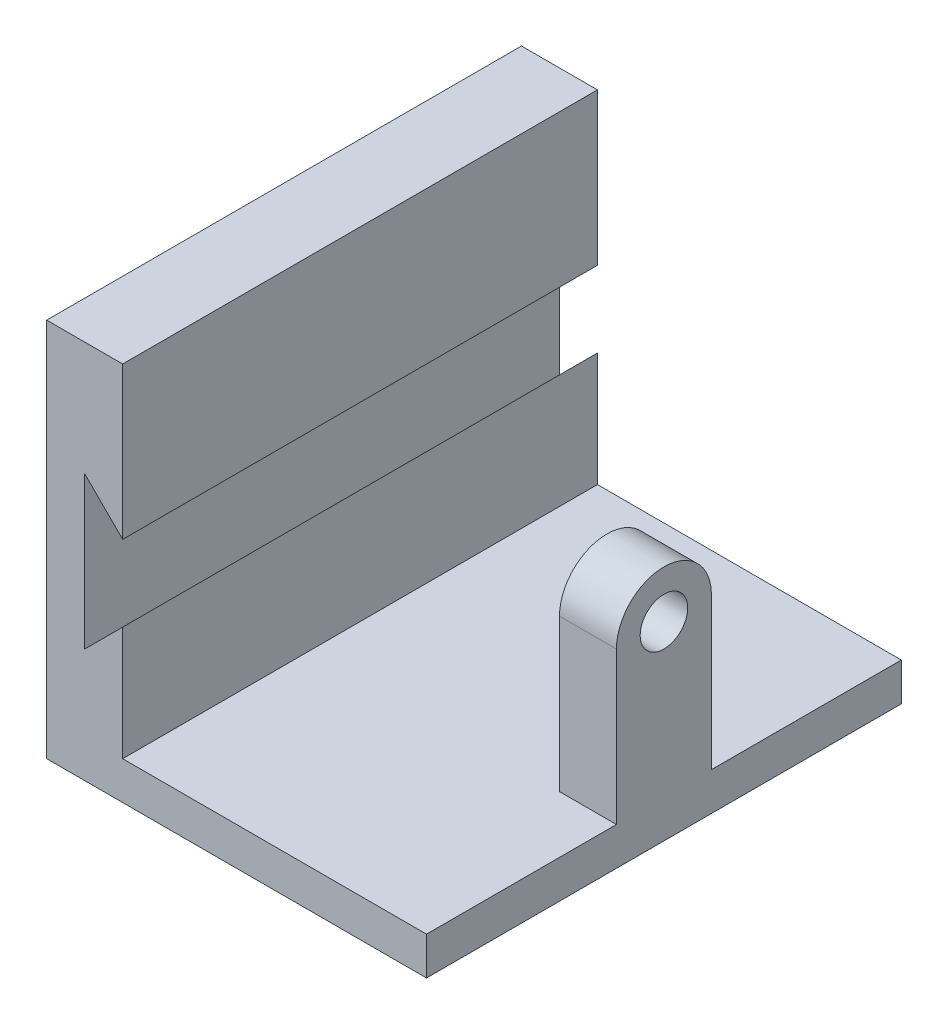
ISO-10303-21;
HEADER;
FILE_DESCRIPTION(('STEP AP214'),'2;1');
FILE_NAME('part.step','',(''),(''),'','','');
FILE_SCHEMA(('AUTOMOTIVE_DESIGN { 1 0 10303 214 1 1 1 1 }'));
ENDSEC;
DATA;
#1=APPLICATION_CONTEXT('core data for automotive mechanical design processes');
#2=APPLICATION_PROTOCOL_DEFINITION('international standard','automotive_design',2000,#1);
#3=PRODUCT_CONTEXT('',#1,'mechanical');
#4=PRODUCT('Part','Part','',(#3));
#5=PRODUCT_RELATED_PRODUCT_CATEGORY('part','',(#4));
#6=PRODUCT_DEFINITION_FORMATION('','',#4);
#7=PRODUCT_DEFINITION_CONTEXT('part definition',#1,'design');
#8=PRODUCT_DEFINITION('design','',#6,#7);
#9=PRODUCT_DEFINITION_SHAPE('','',#8);
#10=(LENGTH_UNIT() NAMED_UNIT(*) SI_UNIT(.MILLI.,.METRE.));
#11=(NAMED_UNIT(*) PLANE_ANGLE_UNIT() SI_UNIT($,.RADIAN.));
#12=(NAMED_UNIT(*) SI_UNIT($,.STERADIAN.) SOLID_ANGLE_UNIT());
#13=UNCERTAINTY_MEASURE_WITH_UNIT(LENGTH_MEASURE(1.E-05),#10,'distance_accuracy_value','');
#14=(GEOMETRIC_REPRESENTATION_CONTEXT(3) GLOBAL_UNCERTAINTY_ASSIGNED_CONTEXT((#13)) GLOBAL_UNIT_ASSIGNED_CONTEXT((#10,
#11,#12)) REPRESENTATION_CONTEXT('',''));
#15=CARTESIAN_POINT('',(0.,0.,0.));
#16=DIRECTION('',(0.,0.,1.));
#17=DIRECTION('',(1.,0.,0.));
#18=AXIS2_PLACEMENT_3D('',#15,#16,#17);
#19=CARTESIAN_POINT('',(0.,20.,125.));
#20=DIRECTION('',(-1.,0.,0.));
#21=DIRECTION('',(0.,-1.,0.));
#22=AXIS2_PLACEMENT_3D('',#19,#20,#21);
#23=PLANE('',#22);
#24=DIRECTION('',(0.,0.,-1.));
#25=VECTOR('',#24,1.);
#26=CARTESIAN_POINT('',(0.,0.,125.));
#27=LINE('',#26,#25);
#28=CARTESIAN_POINT('',(0.,0.,125.));
#29=VERTEX_POINT('',#28);
#30=CARTESIAN_POINT('',(0.,0.,-125.));
#31=VERTEX_POINT('',#30);
#32=EDGE_CURVE('E197',#29,#31,#27,.T.);
#33=ORIENTED_EDGE('',*,*,#32,.T.);
#34=DIRECTION('',(0.,1.,0.));
#35=VECTOR('',#34,1.);
#36=CARTESIAN_POINT('',(0.,20.,-125.));
#37=LINE('',#36,#35);
#38=CARTESIAN_POINT('',(0.,20.,-125.));
#39=VERTEX_POINT('',#38);
#40=EDGE_CURVE('E174',#31,#39,#37,.T.);
#41=ORIENTED_EDGE('',*,*,#40,.T.);
#42=DIRECTION('',(0.,0.,-1.));
#43=VECTOR('',#42,1.);
#44=CARTESIAN_POINT('',(0.,20.,125.));
#45=LINE('',#44,#43);
#46=CARTESIAN_POINT('',(0.,20.,-25.));
#47=VERTEX_POINT('',#46);
#48=EDGE_CURVE('E44',#47,#39,#45,.T.);
#49=ORIENTED_EDGE('',*,*,#48,.F.);
#50=DIRECTION('',(0.,1.,0.));
#51=VECTOR('',#50,1.);
#52=CARTESIAN_POINT('',(0.,0.,-25.));
#53=LINE('',#52,#51);
#54=CARTESIAN_POINT('',(0.,100.,-25.));
#55=VERTEX_POINT('',#54);
#56=EDGE_CURVE('E157',#47,#55,#53,.T.);
#57=ORIENTED_EDGE('',*,*,#56,.T.);
#58=CARTESIAN_POINT('',(0.,100.,0.));
#59=DIRECTION('',(1.,0.,0.));
#60=DIRECTION('',(0.,1.,0.));
#61=AXIS2_PLACEMENT_3D('',#58,#59,#60);
#62=CIRCLE('',#61,25.);
#63=CARTESIAN_POINT('',(0.,100.,25.));
#64=VERTEX_POINT('',#63);
#65=EDGE_CURVE('E165',#55,#64,#62,.T.);
#66=ORIENTED_EDGE('',*,*,#65,.T.);
#67=DIRECTION('',(0.,-1.,0.));
#68=VECTOR('',#67,1.);
#69=CARTESIAN_POINT('',(0.,100.,25.));
#70=LINE('',#69,#68);
#71=CARTESIAN_POINT('',(0.,20.,25.));
#72=VERTEX_POINT('',#71);
#73=EDGE_CURVE('E140',#64,#72,#70,.T.);
#74=ORIENTED_EDGE('',*,*,#73,.T.);
#75=CARTESIAN_POINT('',(0.,20.,125.));
#76=VERTEX_POINT('',#75);
#77=EDGE_CURVE('E11',#76,#72,#45,.T.);
#78=ORIENTED_EDGE('',*,*,#77,.F.);
#79=DIRECTION('',(0.,1.,0.));
#80=VECTOR('',#79,1.);
#81=CARTESIAN_POINT('',(0.,20.,125.));
#82=LINE('',#81,#80);
#83=EDGE_CURVE('E175',#29,#76,#82,.T.);
#84=ORIENTED_EDGE('',*,*,#83,.F.);
#85=EDGE_LOOP('',(#33,#41,#49,#57,#66,#74,#78,#84));
#86=FACE_BOUND('',#85,.T.);
#87=CARTESIAN_POINT('',(0.,100.,0.));
#88=DIRECTION('',(1.,0.,0.));
#89=DIRECTION('',(0.,1.,0.));
#90=AXIS2_PLACEMENT_3D('',#87,#88,#89);
#91=CIRCLE('',#90,12.5);
#92=CARTESIAN_POINT('',(0.,112.5,0.));
#93=VERTEX_POINT('',#92);
#94=EDGE_CURVE('E161',#93,#93,#91,.T.);
#95=ORIENTED_EDGE('',*,*,#94,.F.);
#96=EDGE_LOOP('',(#95));
#97=FACE_BOUND('',#96,.T.);
#98=ADVANCED_FACE('F37',(#86,#97),#23,.F.);
#99=CARTESIAN_POINT('',(-160.,20.,125.));
#100=DIRECTION('',(0.,-1.,0.));
#101=DIRECTION('',(1.,0.,0.));
#102=AXIS2_PLACEMENT_3D('',#99,#100,#101);
#103=PLANE('',#102);
#104=DIRECTION('',(0.,0.,1.));
#105=VECTOR('',#104,1.);
#106=CARTESIAN_POINT('',(-30.,20.,125.));
#107=LINE('',#106,#105);
#108=CARTESIAN_POINT('',(-30.,20.,-25.));
#109=VERTEX_POINT('',#108);
#110=CARTESIAN_POINT('',(-30.,20.,25.));
#111=VERTEX_POINT('',#110);
#112=EDGE_CURVE('E54',#109,#111,#107,.T.);
#113=ORIENTED_EDGE('',*,*,#112,.F.);
#114=DIRECTION('',(1.,0.,0.));
#115=VECTOR('',#114,1.);
#116=CARTESIAN_POINT('',(-160.,20.,-25.));
#117=LINE('',#116,#115);
#118=EDGE_CURVE('E172',#109,#47,#117,.T.);
#119=ORIENTED_EDGE('',*,*,#118,.T.);
#120=ORIENTED_EDGE('',*,*,#48,.T.);
#121=DIRECTION('',(-1.,0.,0.));
#122=VECTOR('',#121,1.);
#123=CARTESIAN_POINT('',(-160.,20.,-125.));
#124=LINE('',#123,#122);
#125=CARTESIAN_POINT('',(-160.,20.,-125.));
#126=VERTEX_POINT('',#125);
#127=EDGE_CURVE('E200',#39,#126,#124,.T.);
#128=ORIENTED_EDGE('',*,*,#127,.T.);
#129=DIRECTION('',(0.,0.,-1.));
#130=VECTOR('',#129,1.);
#131=CARTESIAN_POINT('',(-160.,20.,125.));
#132=LINE('',#131,#130);
#133=CARTESIAN_POINT('',(-160.,20.,125.));
#134=VERTEX_POINT('',#133);
#135=EDGE_CURVE('E239',#134,#126,#132,.T.);
#136=ORIENTED_EDGE('',*,*,#135,.F.);
#137=DIRECTION('',(-1.,0.,0.));
#138=VECTOR('',#137,1.);
#139=CARTESIAN_POINT('',(-160.,20.,125.));
#140=LINE('',#139,#138);
#141=EDGE_CURVE('E178',#76,#134,#140,.T.);
#142=ORIENTED_EDGE('',*,*,#141,.F.);
#143=ORIENTED_EDGE('',*,*,#77,.T.);
#144=DIRECTION('',(-1.,0.,0.));
#145=VECTOR('',#144,1.);
#146=CARTESIAN_POINT('',(-160.,20.,25.));
#147=LINE('',#146,#145);
#148=EDGE_CURVE('E50',#72,#111,#147,.T.);
#149=ORIENTED_EDGE('',*,*,#148,.T.);
#150=EDGE_LOOP('',(#113,#119,#120,#128,#136,#142,#143,#149));
#151=FACE_BOUND('',#150,.T.);
#152=ADVANCED_FACE('F246',(#151),#103,.F.);
#153=CARTESIAN_POINT('',(-160.,80.,125.));
#154=DIRECTION('',(-1.,0.,0.));
#155=DIRECTION('',(0.,0.,1.));
#156=AXIS2_PLACEMENT_3D('',#153,#154,#155);
#157=PLANE('',#156);
#158=DIRECTION('',(0.,1.,0.));
#159=VECTOR('',#158,1.);
#160=CARTESIAN_POINT('',(-160.,80.,-125.));
#161=LINE('',#160,#159);
#162=CARTESIAN_POINT('',(-160.,80.,-125.));
#163=VERTEX_POINT('',#162);
#164=EDGE_CURVE('E202',#126,#163,#161,.T.);
#165=ORIENTED_EDGE('',*,*,#164,.T.);
#166=DIRECTION('',(0.,0.,-1.));
#167=VECTOR('',#166,1.);
#168=CARTESIAN_POINT('',(-160.,80.,125.));
#169=LINE('',#168,#167);
#170=CARTESIAN_POINT('',(-160.,80.,125.));
#171=VERTEX_POINT('',#170);
#172=EDGE_CURVE('E237',#171,#163,#169,.T.);
#173=ORIENTED_EDGE('',*,*,#172,.F.);
#174=DIRECTION('',(0.,1.,0.));
#175=VECTOR('',#174,1.);
#176=CARTESIAN_POINT('',(-160.,80.,125.));
#177=LINE('',#176,#175);
#178=EDGE_CURVE('E181',#134,#171,#177,.T.);
#179=ORIENTED_EDGE('',*,*,#178,.F.);
#180=ORIENTED_EDGE('',*,*,#135,.T.);
#181=EDGE_LOOP('',(#165,#173,#179,#180));
#182=FACE_BOUND('',#181,.T.);
#183=ADVANCED_FACE('F291',(#182),#157,.F.);
#184=CARTESIAN_POINT('',(-160.,80.,125.));
#185=DIRECTION('',(0.707106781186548,-0.707106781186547,0.));
#186=DIRECTION('',(0.707106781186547,0.707106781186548,0.));
#187=AXIS2_PLACEMENT_3D('',#184,#185,#186);
#188=PLANE('',#187);
#189=DIRECTION('',(-0.707106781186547,-0.707106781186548,0.));
#190=VECTOR('',#189,1.);
#191=CARTESIAN_POINT('',(-160.,80.,-125.));
#192=LINE('',#191,#190);
#193=CARTESIAN_POINT('',(-180.,60.,-125.));
#194=VERTEX_POINT('',#193);
#195=EDGE_CURVE('E204',#163,#194,#192,.T.);
#196=ORIENTED_EDGE('',*,*,#195,.T.);
#197=DIRECTION('',(0.,0.,-1.));
#198=VECTOR('',#197,1.);
#199=CARTESIAN_POINT('',(-180.,60.,125.));
#200=LINE('',#199,#198);
#201=CARTESIAN_POINT('',(-180.,60.,125.));
#202=VERTEX_POINT('',#201);
#203=EDGE_CURVE('E234',#202,#194,#200,.T.);
#204=ORIENTED_EDGE('',*,*,#203,.F.);
#205=DIRECTION('',(-0.707106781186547,-0.707106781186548,0.));
#206=VECTOR('',#205,1.);
#207=CARTESIAN_POINT('',(-160.,80.,125.));
#208=LINE('',#207,#206);
#209=EDGE_CURVE('E183',#171,#202,#208,.T.);
#210=ORIENTED_EDGE('',*,*,#209,.F.);
#211=ORIENTED_EDGE('',*,*,#172,.T.);
#212=EDGE_LOOP('',(#196,#204,#210,#211));
#213=FACE_BOUND('',#212,.T.);
#214=ADVANCED_FACE('F289',(#213),#188,.F.);
#215=CARTESIAN_POINT('',(-180.,60.,125.));
#216=DIRECTION('',(-1.,0.,0.));
#217=DIRECTION('',(0.,0.,1.));
#218=AXIS2_PLACEMENT_3D('',#215,#216,#217);
#219=PLANE('',#218);
#220=DIRECTION('',(0.,1.,0.));
#221=VECTOR('',#220,1.);
#222=CARTESIAN_POINT('',(-180.,60.,-125.));
#223=LINE('',#222,#221);
#224=CARTESIAN_POINT('',(-180.,140.,-125.));
#225=VERTEX_POINT('',#224);
#226=EDGE_CURVE('E206',#194,#225,#223,.T.);
#227=ORIENTED_EDGE('',*,*,#226,.T.);
#228=DIRECTION('',(0.,0.,-1.));
#229=VECTOR('',#228,1.);
#230=CARTESIAN_POINT('',(-180.,140.,125.));
#231=LINE('',#230,#229);
#232=CARTESIAN_POINT('',(-180.,140.,125.));
#233=VERTEX_POINT('',#232);
#234=EDGE_CURVE('E231',#233,#225,#231,.T.);
#235=ORIENTED_EDGE('',*,*,#234,.F.);
#236=DIRECTION('',(0.,1.,0.));
#237=VECTOR('',#236,1.);
#238=CARTESIAN_POINT('',(-180.,60.,125.));
#239=LINE('',#238,#237);
#240=EDGE_CURVE('E185',#202,#233,#239,.T.);
#241=ORIENTED_EDGE('',*,*,#240,.F.);
#242=ORIENTED_EDGE('',*,*,#203,.T.);
#243=EDGE_LOOP('',(#227,#235,#241,#242));
#244=FACE_BOUND('',#243,.T.);
#245=ADVANCED_FACE('F285',(#244),#219,.F.);
#246=CARTESIAN_POINT('',(-180.,140.,125.));
#247=DIRECTION('',(0.707106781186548,0.707106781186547,0.));
#248=DIRECTION('',(-0.707106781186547,0.707106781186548,0.));
#249=AXIS2_PLACEMENT_3D('',#246,#247,#248);
#250=PLANE('',#249);
#251=DIRECTION('',(0.707106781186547,-0.707106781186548,0.));
#252=VECTOR('',#251,1.);
#253=CARTESIAN_POINT('',(-180.,140.,-125.));
#254=LINE('',#253,#252);
#255=CARTESIAN_POINT('',(-160.,120.,-125.));
#256=VERTEX_POINT('',#255);
#257=EDGE_CURVE('E208',#225,#256,#254,.T.);
#258=ORIENTED_EDGE('',*,*,#257,.T.);
#259=DIRECTION('',(0.,0.,-1.));
#260=VECTOR('',#259,1.);
#261=CARTESIAN_POINT('',(-160.,120.,125.));
#262=LINE('',#261,#260);
#263=CARTESIAN_POINT('',(-160.,120.,125.));
#264=VERTEX_POINT('',#263);
#265=EDGE_CURVE('E228',#264,#256,#262,.T.);
#266=ORIENTED_EDGE('',*,*,#265,.F.);
#267=DIRECTION('',(0.707106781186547,-0.707106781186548,0.));
#268=VECTOR('',#267,1.);
#269=CARTESIAN_POINT('',(-180.,140.,125.));
#270=LINE('',#269,#268);
#271=EDGE_CURVE('E187',#233,#264,#270,.T.);
#272=ORIENTED_EDGE('',*,*,#271,.F.);
#273=ORIENTED_EDGE('',*,*,#234,.T.);
#274=EDGE_LOOP('',(#258,#266,#272,#273));
#275=FACE_BOUND('',#274,.T.);
#276=ADVANCED_FACE('F280',(#275),#250,.F.);
#277=CARTESIAN_POINT('',(-160.,200.,125.));
#278=DIRECTION('',(-1.,0.,0.));
#279=DIRECTION('',(0.,0.,1.));
#280=AXIS2_PLACEMENT_3D('',#277,#278,#279);
#281=PLANE('',#280);
#282=DIRECTION('',(0.,1.,0.));
#283=VECTOR('',#282,1.);
#284=CARTESIAN_POINT('',(-160.,200.,-125.));
#285=LINE('',#284,#283);
#286=CARTESIAN_POINT('',(-160.,200.,-125.));
#287=VERTEX_POINT('',#286);
#288=EDGE_CURVE('E210',#256,#287,#285,.T.);
#289=ORIENTED_EDGE('',*,*,#288,.T.);
#290=DIRECTION('',(0.,0.,-1.));
#291=VECTOR('',#290,1.);
#292=CARTESIAN_POINT('',(-160.,200.,125.));
#293=LINE('',#292,#291);
#294=CARTESIAN_POINT('',(-160.,200.,125.));
#295=VERTEX_POINT('',#294);
#296=EDGE_CURVE('E225',#295,#287,#293,.T.);
#297=ORIENTED_EDGE('',*,*,#296,.F.);
#298=DIRECTION('',(0.,1.,0.));
#299=VECTOR('',#298,1.);
#300=CARTESIAN_POINT('',(-160.,200.,125.));
#301=LINE('',#300,#299);
#302=EDGE_CURVE('E189',#264,#295,#301,.T.);
#303=ORIENTED_EDGE('',*,*,#302,.F.);
#304=ORIENTED_EDGE('',*,*,#265,.T.);
#305=EDGE_LOOP('',(#289,#297,#303,#304));
#306=FACE_BOUND('',#305,.T.);
#307=ADVANCED_FACE('F275',(#306),#281,.F.);
#308=CARTESIAN_POINT('',(-200.,200.,125.));
#309=DIRECTION('',(0.,-1.,0.));
#310=DIRECTION('',(0.,0.,-1.));
#311=AXIS2_PLACEMENT_3D('',#308,#309,#310);
#312=PLANE('',#311);
#313=DIRECTION('',(-1.,0.,0.));
#314=VECTOR('',#313,1.);
#315=CARTESIAN_POINT('',(-200.,200.,-125.));
#316=LINE('',#315,#314);
#317=CARTESIAN_POINT('',(-200.,200.,-125.));
#318=VERTEX_POINT('',#317);
#319=EDGE_CURVE('E212',#287,#318,#316,.T.);
#320=ORIENTED_EDGE('',*,*,#319,.T.);
#321=DIRECTION('',(0.,0.,-1.));
#322=VECTOR('',#321,1.);
#323=CARTESIAN_POINT('',(-200.,200.,125.));
#324=LINE('',#323,#322);
#325=CARTESIAN_POINT('',(-200.,200.,125.));
#326=VERTEX_POINT('',#325);
#327=EDGE_CURVE('E222',#326,#318,#324,.T.);
#328=ORIENTED_EDGE('',*,*,#327,.F.);
#329=DIRECTION('',(-1.,0.,0.));
#330=VECTOR('',#329,1.);
#331=CARTESIAN_POINT('',(-200.,200.,125.));
#332=LINE('',#331,#330);
#333=EDGE_CURVE('E191',#295,#326,#332,.T.);
#334=ORIENTED_EDGE('',*,*,#333,.F.);
#335=ORIENTED_EDGE('',*,*,#296,.T.);
#336=EDGE_LOOP('',(#320,#328,#334,#335));
#337=FACE_BOUND('',#336,.T.);
#338=ADVANCED_FACE('F271',(#337),#312,.F.);
#339=CARTESIAN_POINT('',(-200.,0.,125.));
#340=DIRECTION('',(1.,0.,0.));
#341=DIRECTION('',(0.,0.,-1.));
#342=AXIS2_PLACEMENT_3D('',#339,#340,#341);
#343=PLANE('',#342);
#344=DIRECTION('',(0.,-1.,0.));
#345=VECTOR('',#344,1.);
#346=CARTESIAN_POINT('',(-200.,0.,-125.));
#347=LINE('',#346,#345);
#348=CARTESIAN_POINT('',(-200.,0.,-125.));
#349=VERTEX_POINT('',#348);
#350=EDGE_CURVE('E214',#318,#349,#347,.T.);
#351=ORIENTED_EDGE('',*,*,#350,.T.);
#352=DIRECTION('',(0.,0.,-1.));
#353=VECTOR('',#352,1.);
#354=CARTESIAN_POINT('',(-200.,0.,125.));
#355=LINE('',#354,#353);
#356=CARTESIAN_POINT('',(-200.,0.,125.));
#357=VERTEX_POINT('',#356);
#358=EDGE_CURVE('E219',#357,#349,#355,.T.);
#359=ORIENTED_EDGE('',*,*,#358,.F.);
#360=DIRECTION('',(0.,-1.,0.));
#361=VECTOR('',#360,1.);
#362=CARTESIAN_POINT('',(-200.,0.,125.));
#363=LINE('',#362,#361);
#364=EDGE_CURVE('E193',#326,#357,#363,.T.);
#365=ORIENTED_EDGE('',*,*,#364,.F.);
#366=ORIENTED_EDGE('',*,*,#327,.T.);
#367=EDGE_LOOP('',(#351,#359,#365,#366));
#368=FACE_BOUND('',#367,.T.);
#369=ADVANCED_FACE('F266',(#368),#343,.F.);
#370=CARTESIAN_POINT('',(0.,0.,125.));
#371=DIRECTION('',(0.,1.,0.));
#372=DIRECTION('',(0.,0.,1.));
#373=AXIS2_PLACEMENT_3D('',#370,#371,#372);
#374=PLANE('',#373);
#375=DIRECTION('',(1.,0.,0.));
#376=VECTOR('',#375,1.);
#377=CARTESIAN_POINT('',(0.,0.,-125.));
#378=LINE('',#377,#376);
#379=EDGE_CURVE('E179',#349,#31,#378,.T.);
#380=ORIENTED_EDGE('',*,*,#379,.T.);
#381=ORIENTED_EDGE('',*,*,#32,.F.);
#382=DIRECTION('',(1.,0.,0.));
#383=VECTOR('',#382,1.);
#384=CARTESIAN_POINT('',(0.,0.,125.));
#385=LINE('',#384,#383);
#386=EDGE_CURVE('E195',#357,#29,#385,.T.);
#387=ORIENTED_EDGE('',*,*,#386,.F.);
#388=ORIENTED_EDGE('',*,*,#358,.T.);
#389=EDGE_LOOP('',(#380,#381,#387,#388));
#390=FACE_BOUND('',#389,.T.);
#391=ADVANCED_FACE('F260',(#390),#374,.F.);
#392=CARTESIAN_POINT('',(0.,0.,125.));
#393=DIRECTION('',(0.,0.,-1.));
#394=DIRECTION('',(-1.,0.,0.));
#395=AXIS2_PLACEMENT_3D('',#392,#393,#394);
#396=PLANE('',#395);
#397=ORIENTED_EDGE('',*,*,#83,.T.);
#398=ORIENTED_EDGE('',*,*,#141,.T.);
#399=ORIENTED_EDGE('',*,*,#178,.T.);
#400=ORIENTED_EDGE('',*,*,#209,.T.);
#401=ORIENTED_EDGE('',*,*,#240,.T.);
#402=ORIENTED_EDGE('',*,*,#271,.T.);
#403=ORIENTED_EDGE('',*,*,#302,.T.);
#404=ORIENTED_EDGE('',*,*,#333,.T.);
#405=ORIENTED_EDGE('',*,*,#364,.T.);
#406=ORIENTED_EDGE('',*,*,#386,.T.);
#407=EDGE_LOOP('',(#397,#398,#399,#400,#401,#402,#403,#404,#405,#406));
#408=FACE_BOUND('',#407,.T.);
#409=ADVANCED_FACE('F293',(#408),#396,.F.);
#410=CARTESIAN_POINT('',(0.,0.,-125.));
#411=DIRECTION('',(0.,0.,-1.));
#412=DIRECTION('',(-1.,0.,0.));
#413=AXIS2_PLACEMENT_3D('',#410,#411,#412);
#414=PLANE('',#413);
#415=ORIENTED_EDGE('',*,*,#40,.F.);
#416=ORIENTED_EDGE('',*,*,#379,.F.);
#417=ORIENTED_EDGE('',*,*,#350,.F.);
#418=ORIENTED_EDGE('',*,*,#319,.F.);
#419=ORIENTED_EDGE('',*,*,#288,.F.);
#420=ORIENTED_EDGE('',*,*,#257,.F.);
#421=ORIENTED_EDGE('',*,*,#226,.F.);
#422=ORIENTED_EDGE('',*,*,#195,.F.);
#423=ORIENTED_EDGE('',*,*,#164,.F.);
#424=ORIENTED_EDGE('',*,*,#127,.F.);
#425=EDGE_LOOP('',(#415,#416,#417,#418,#419,#420,#421,#422,#423,#424));
#426=FACE_BOUND('',#425,.T.);
#427=ADVANCED_FACE('F251',(#426),#414,.T.);
#428=CARTESIAN_POINT('',(-30.,0.,-25.));
#429=DIRECTION('',(0.,0.,-1.));
#430=DIRECTION('',(0.,1.,0.));
#431=AXIS2_PLACEMENT_3D('',#428,#429,#430);
#432=PLANE('',#431);
#433=ORIENTED_EDGE('',*,*,#118,.F.);
#434=DIRECTION('',(0.,1.,0.));
#435=VECTOR('',#434,1.);
#436=CARTESIAN_POINT('',(-30.,0.,-25.));
#437=LINE('',#436,#435);
#438=CARTESIAN_POINT('',(-30.,100.,-25.));
#439=VERTEX_POINT('',#438);
#440=EDGE_CURVE('E146',#109,#439,#437,.T.);
#441=ORIENTED_EDGE('',*,*,#440,.T.);
#442=DIRECTION('',(1.,0.,0.));
#443=VECTOR('',#442,1.);
#444=CARTESIAN_POINT('',(-30.,100.,-25.));
#445=LINE('',#444,#443);
#446=EDGE_CURVE('E145',#439,#55,#445,.T.);
#447=ORIENTED_EDGE('',*,*,#446,.T.);
#448=ORIENTED_EDGE('',*,*,#56,.F.);
#449=EDGE_LOOP('',(#433,#441,#447,#448));
#450=FACE_BOUND('',#449,.T.);
#451=ADVANCED_FACE('F295',(#450),#432,.T.);
#452=CARTESIAN_POINT('',(-30.,100.,25.));
#453=DIRECTION('',(0.,0.,1.));
#454=DIRECTION('',(0.,-1.,0.));
#455=AXIS2_PLACEMENT_3D('',#452,#453,#454);
#456=PLANE('',#455);
#457=ORIENTED_EDGE('',*,*,#148,.F.);
#458=ORIENTED_EDGE('',*,*,#73,.F.);
#459=DIRECTION('',(1.,0.,0.));
#460=VECTOR('',#459,1.);
#461=CARTESIAN_POINT('',(-30.,100.,25.));
#462=LINE('',#461,#460);
#463=CARTESIAN_POINT('',(-30.,100.,25.));
#464=VERTEX_POINT('',#463);
#465=EDGE_CURVE('E135',#464,#64,#462,.T.);
#466=ORIENTED_EDGE('',*,*,#465,.F.);
#467=DIRECTION('',(0.,-1.,0.));
#468=VECTOR('',#467,1.);
#469=CARTESIAN_POINT('',(-30.,100.,25.));
#470=LINE('',#469,#468);
#471=EDGE_CURVE('E138',#464,#111,#470,.T.);
#472=ORIENTED_EDGE('',*,*,#471,.T.);
#473=EDGE_LOOP('',(#457,#458,#466,#472));
#474=FACE_BOUND('',#473,.T.);
#475=ADVANCED_FACE('F137',(#474),#456,.T.);
#476=CARTESIAN_POINT('',(-30.,100.,0.));
#477=DIRECTION('',(1.,0.,0.));
#478=DIRECTION('',(0.,1.,0.));
#479=AXIS2_PLACEMENT_3D('',#476,#477,#478);
#480=PLANE('',#479);
#481=CARTESIAN_POINT('',(-30.,100.,0.));
#482=DIRECTION('',(1.,0.,0.));
#483=DIRECTION('',(0.,1.,0.));
#484=AXIS2_PLACEMENT_3D('',#481,#482,#483);
#485=CIRCLE('',#484,12.5);
#486=CARTESIAN_POINT('',(-30.,112.5,0.));
#487=VERTEX_POINT('',#486);
#488=EDGE_CURVE('E167',#487,#487,#485,.T.);
#489=ORIENTED_EDGE('',*,*,#488,.T.);
#490=EDGE_LOOP('',(#489));
#491=FACE_BOUND('',#490,.T.);
#492=ORIENTED_EDGE('',*,*,#440,.F.);
#493=ORIENTED_EDGE('',*,*,#112,.T.);
#494=ORIENTED_EDGE('',*,*,#471,.F.);
#495=CARTESIAN_POINT('',(-30.,100.,0.));
#496=DIRECTION('',(1.,0.,0.));
#497=DIRECTION('',(0.,1.,0.));
#498=AXIS2_PLACEMENT_3D('',#495,#496,#497);
#499=CIRCLE('',#498,25.);
#500=EDGE_CURVE('E152',#439,#464,#499,.T.);
#501=ORIENTED_EDGE('',*,*,#500,.F.);
#502=EDGE_LOOP('',(#492,#493,#494,#501));
#503=FACE_BOUND('',#502,.T.);
#504=ADVANCED_FACE('F151',(#491,#503),#480,.F.);
#505=CARTESIAN_POINT('',(-30.,100.,0.));
#506=DIRECTION('',(1.,0.,0.));
#507=DIRECTION('',(0.,1.,0.));
#508=AXIS2_PLACEMENT_3D('',#505,#506,#507);
#509=CYLINDRICAL_SURFACE('',#508,25.);
#510=ORIENTED_EDGE('',*,*,#65,.F.);
#511=ORIENTED_EDGE('',*,*,#446,.F.);
#512=ORIENTED_EDGE('',*,*,#500,.T.);
#513=ORIENTED_EDGE('',*,*,#465,.T.);
#514=EDGE_LOOP('',(#510,#511,#512,#513));
#515=FACE_BOUND('',#514,.T.);
#516=ADVANCED_FACE('F155',(#515),#509,.T.);
#517=CARTESIAN_POINT('',(-30.,100.,0.));
#518=DIRECTION('',(1.,0.,0.));
#519=DIRECTION('',(0.,1.,0.));
#520=AXIS2_PLACEMENT_3D('',#517,#518,#519);
#521=CYLINDRICAL_SURFACE('',#520,12.5);
#522=ORIENTED_EDGE('',*,*,#488,.F.);
#523=EDGE_LOOP('',(#522));
#524=FACE_BOUND('',#523,.T.);
#525=ORIENTED_EDGE('',*,*,#94,.T.);
#526=EDGE_LOOP('',(#525));
#527=FACE_BOUND('',#526,.T.);
#528=ADVANCED_FACE('F331',(#524,#527),#521,.F.);
#529=CLOSED_SHELL('',(#98,#152,#183,#214,#245,#276,#307,#338,#369,#391,#409,#427,#451,#475,#504,
#516,#528));
#530=MANIFOLD_SOLID_BREP('B2',#529);
#531=ADVANCED_BREP_SHAPE_REPRESENTATION('',(#18,#530),#14);
#532=SHAPE_DEFINITION_REPRESENTATION(#9,#531);
ENDSEC;
END-ISO-10303-21;
